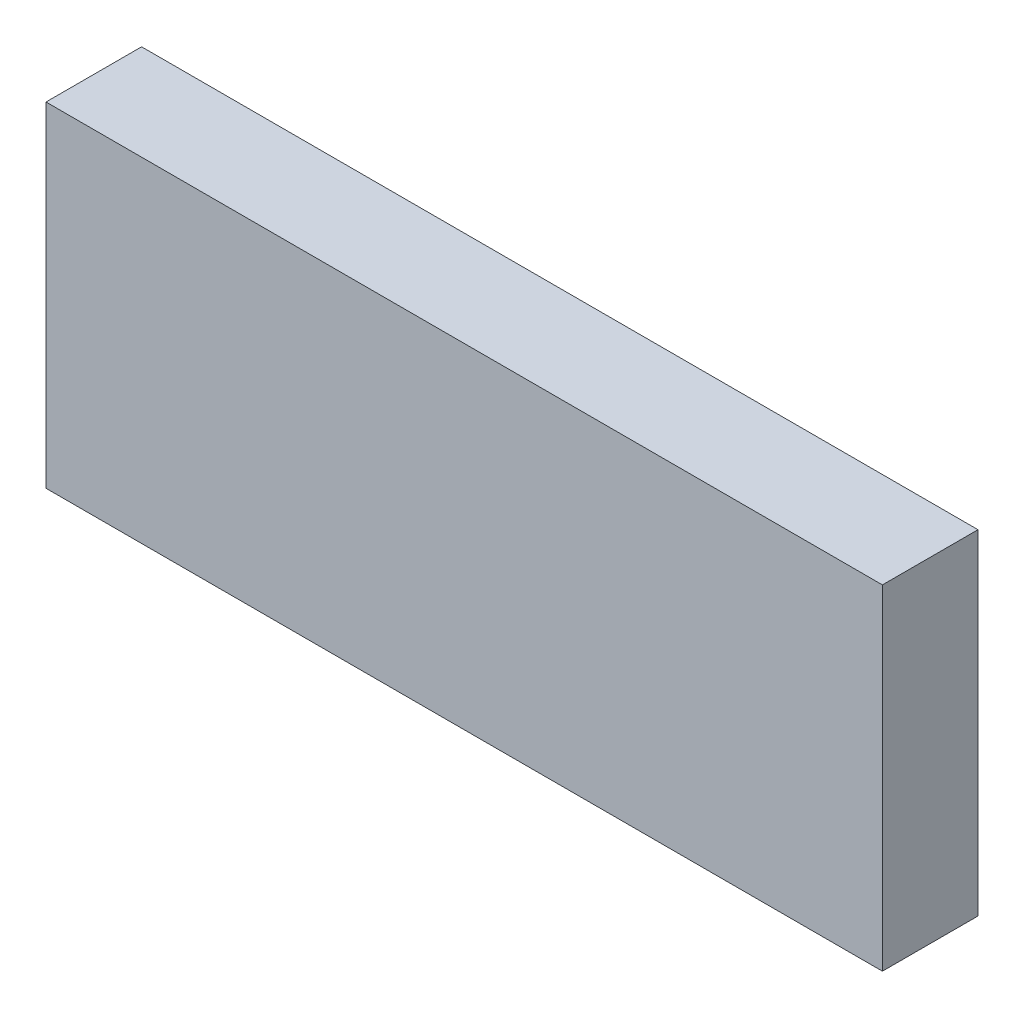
ISO-10303-21;
HEADER;
FILE_DESCRIPTION(('STEP AP214'),'2;1');
FILE_NAME('part.step','',(''),(''),'','','');
FILE_SCHEMA(('AUTOMOTIVE_DESIGN { 1 0 10303 214 1 1 1 1 }'));
ENDSEC;
DATA;
#1=APPLICATION_CONTEXT('core data for automotive mechanical design processes');
#2=APPLICATION_PROTOCOL_DEFINITION('international standard','automotive_design',2000,#1);
#3=PRODUCT_CONTEXT('',#1,'mechanical');
#4=PRODUCT('Part','Part','',(#3));
#5=PRODUCT_RELATED_PRODUCT_CATEGORY('part','',(#4));
#6=PRODUCT_DEFINITION_FORMATION('','',#4);
#7=PRODUCT_DEFINITION_CONTEXT('part definition',#1,'design');
#8=PRODUCT_DEFINITION('design','',#6,#7);
#9=PRODUCT_DEFINITION_SHAPE('','',#8);
#10=(LENGTH_UNIT() NAMED_UNIT(*) SI_UNIT(.MILLI.,.METRE.));
#11=(NAMED_UNIT(*) PLANE_ANGLE_UNIT() SI_UNIT($,.RADIAN.));
#12=(NAMED_UNIT(*) SI_UNIT($,.STERADIAN.) SOLID_ANGLE_UNIT());
#13=UNCERTAINTY_MEASURE_WITH_UNIT(LENGTH_MEASURE(1.E-05),#10,'distance_accuracy_value','');
#14=(GEOMETRIC_REPRESENTATION_CONTEXT(3) GLOBAL_UNCERTAINTY_ASSIGNED_CONTEXT((#13)) GLOBAL_UNIT_ASSIGNED_CONTEXT((#10,
#11,#12)) REPRESENTATION_CONTEXT('',''));
#15=CARTESIAN_POINT('',(0.,0.,0.));
#16=DIRECTION('',(0.,0.,1.));
#17=DIRECTION('',(1.,0.,0.));
#18=AXIS2_PLACEMENT_3D('',#15,#16,#17);
#19=CARTESIAN_POINT('',(0.,0.,4.));
#20=DIRECTION('',(1.,0.,0.));
#21=DIRECTION('',(0.,0.,-1.));
#22=AXIS2_PLACEMENT_3D('',#19,#20,#21);
#23=PLANE('',#22);
#24=DIRECTION('',(0.,-1.,0.));
#25=VECTOR('',#24,1.);
#26=CARTESIAN_POINT('',(0.,0.,0.));
#27=LINE('',#26,#25);
#28=CARTESIAN_POINT('',(0.,14.,0.));
#29=VERTEX_POINT('',#28);
#30=CARTESIAN_POINT('',(0.,0.,0.));
#31=VERTEX_POINT('',#30);
#32=EDGE_CURVE('E105',#29,#31,#27,.T.);
#33=ORIENTED_EDGE('',*,*,#32,.T.);
#34=DIRECTION('',(0.,0.,-1.));
#35=VECTOR('',#34,1.);
#36=CARTESIAN_POINT('',(0.,0.,4.));
#37=LINE('',#36,#35);
#38=CARTESIAN_POINT('',(0.,0.,4.));
#39=VERTEX_POINT('',#38);
#40=EDGE_CURVE('E11',#39,#31,#37,.T.);
#41=ORIENTED_EDGE('',*,*,#40,.F.);
#42=DIRECTION('',(0.,-1.,0.));
#43=VECTOR('',#42,1.);
#44=CARTESIAN_POINT('',(0.,0.,4.));
#45=LINE('',#44,#43);
#46=CARTESIAN_POINT('',(0.,14.,4.));
#47=VERTEX_POINT('',#46);
#48=EDGE_CURVE('E89',#47,#39,#45,.T.);
#49=ORIENTED_EDGE('',*,*,#48,.F.);
#50=DIRECTION('',(0.,0.,-1.));
#51=VECTOR('',#50,1.);
#52=CARTESIAN_POINT('',(0.,14.,4.));
#53=LINE('',#52,#51);
#54=EDGE_CURVE('E98',#47,#29,#53,.T.);
#55=ORIENTED_EDGE('',*,*,#54,.T.);
#56=EDGE_LOOP('',(#33,#41,#49,#55));
#57=FACE_BOUND('',#56,.T.);
#58=ADVANCED_FACE('F39',(#57),#23,.F.);
#59=CARTESIAN_POINT('',(0.,0.,4.));
#60=DIRECTION('',(0.,1.,0.));
#61=DIRECTION('',(0.,0.,1.));
#62=AXIS2_PLACEMENT_3D('',#59,#60,#61);
#63=PLANE('',#62);
#64=DIRECTION('',(1.,0.,0.));
#65=VECTOR('',#64,1.);
#66=CARTESIAN_POINT('',(0.,0.,0.));
#67=LINE('',#66,#65);
#68=CARTESIAN_POINT('',(35.,0.,0.));
#69=VERTEX_POINT('',#68);
#70=EDGE_CURVE('E94',#31,#69,#67,.T.);
#71=ORIENTED_EDGE('',*,*,#70,.T.);
#72=DIRECTION('',(0.,0.,-1.));
#73=VECTOR('',#72,1.);
#74=CARTESIAN_POINT('',(35.,0.,4.));
#75=LINE('',#74,#73);
#76=CARTESIAN_POINT('',(35.,0.,4.));
#77=VERTEX_POINT('',#76);
#78=EDGE_CURVE('E50',#77,#69,#75,.T.);
#79=ORIENTED_EDGE('',*,*,#78,.F.);
#80=DIRECTION('',(1.,0.,0.));
#81=VECTOR('',#80,1.);
#82=CARTESIAN_POINT('',(0.,0.,4.));
#83=LINE('',#82,#81);
#84=EDGE_CURVE('E83',#39,#77,#83,.T.);
#85=ORIENTED_EDGE('',*,*,#84,.F.);
#86=ORIENTED_EDGE('',*,*,#40,.T.);
#87=EDGE_LOOP('',(#71,#79,#85,#86));
#88=FACE_BOUND('',#87,.T.);
#89=ADVANCED_FACE('F91',(#88),#63,.F.);
#90=CARTESIAN_POINT('',(35.,0.,4.));
#91=DIRECTION('',(-1.,0.,0.));
#92=DIRECTION('',(0.,0.,1.));
#93=AXIS2_PLACEMENT_3D('',#90,#91,#92);
#94=PLANE('',#93);
#95=DIRECTION('',(0.,1.,0.));
#96=VECTOR('',#95,1.);
#97=CARTESIAN_POINT('',(35.,0.,0.));
#98=LINE('',#97,#96);
#99=CARTESIAN_POINT('',(35.,14.,0.));
#100=VERTEX_POINT('',#99);
#101=EDGE_CURVE('E75',#69,#100,#98,.T.);
#102=ORIENTED_EDGE('',*,*,#101,.T.);
#103=DIRECTION('',(0.,0.,-1.));
#104=VECTOR('',#103,1.);
#105=CARTESIAN_POINT('',(35.,14.,4.));
#106=LINE('',#105,#104);
#107=CARTESIAN_POINT('',(35.,14.,4.));
#108=VERTEX_POINT('',#107);
#109=EDGE_CURVE('E92',#108,#100,#106,.T.);
#110=ORIENTED_EDGE('',*,*,#109,.F.);
#111=DIRECTION('',(0.,1.,0.));
#112=VECTOR('',#111,1.);
#113=CARTESIAN_POINT('',(35.,0.,4.));
#114=LINE('',#113,#112);
#115=EDGE_CURVE('E86',#77,#108,#114,.T.);
#116=ORIENTED_EDGE('',*,*,#115,.F.);
#117=ORIENTED_EDGE('',*,*,#78,.T.);
#118=EDGE_LOOP('',(#102,#110,#116,#117));
#119=FACE_BOUND('',#118,.T.);
#120=ADVANCED_FACE('F96',(#119),#94,.F.);
#121=CARTESIAN_POINT('',(0.,14.,4.));
#122=DIRECTION('',(0.,-1.,0.));
#123=DIRECTION('',(0.,0.,-1.));
#124=AXIS2_PLACEMENT_3D('',#121,#122,#123);
#125=PLANE('',#124);
#126=DIRECTION('',(-1.,0.,0.));
#127=VECTOR('',#126,1.);
#128=CARTESIAN_POINT('',(0.,14.,0.));
#129=LINE('',#128,#127);
#130=EDGE_CURVE('E77',#100,#29,#129,.T.);
#131=ORIENTED_EDGE('',*,*,#130,.T.);
#132=ORIENTED_EDGE('',*,*,#54,.F.);
#133=DIRECTION('',(-1.,0.,0.));
#134=VECTOR('',#133,1.);
#135=CARTESIAN_POINT('',(0.,14.,4.));
#136=LINE('',#135,#134);
#137=EDGE_CURVE('E54',#108,#47,#136,.T.);
#138=ORIENTED_EDGE('',*,*,#137,.F.);
#139=ORIENTED_EDGE('',*,*,#109,.T.);
#140=EDGE_LOOP('',(#131,#132,#138,#139));
#141=FACE_BOUND('',#140,.T.);
#142=ADVANCED_FACE('F108',(#141),#125,.F.);
#143=CARTESIAN_POINT('',(0.,0.,4.));
#144=DIRECTION('',(0.,0.,-1.));
#145=DIRECTION('',(-1.,0.,0.));
#146=AXIS2_PLACEMENT_3D('',#143,#144,#145);
#147=PLANE('',#146);
#148=ORIENTED_EDGE('',*,*,#48,.T.);
#149=ORIENTED_EDGE('',*,*,#84,.T.);
#150=ORIENTED_EDGE('',*,*,#115,.T.);
#151=ORIENTED_EDGE('',*,*,#137,.T.);
#152=EDGE_LOOP('',(#148,#149,#150,#151));
#153=FACE_BOUND('',#152,.T.);
#154=ADVANCED_FACE('F88',(#153),#147,.F.);
#155=CARTESIAN_POINT('',(0.,0.,0.));
#156=DIRECTION('',(0.,0.,-1.));
#157=DIRECTION('',(-1.,0.,0.));
#158=AXIS2_PLACEMENT_3D('',#155,#156,#157);
#159=PLANE('',#158);
#160=ORIENTED_EDGE('',*,*,#32,.F.);
#161=ORIENTED_EDGE('',*,*,#130,.F.);
#162=ORIENTED_EDGE('',*,*,#101,.F.);
#163=ORIENTED_EDGE('',*,*,#70,.F.);
#164=EDGE_LOOP('',(#160,#161,#162,#163));
#165=FACE_BOUND('',#164,.T.);
#166=ADVANCED_FACE('F115',(#165),#159,.T.);
#167=CLOSED_SHELL('',(#58,#89,#120,#142,#154,#166));
#168=MANIFOLD_SOLID_BREP('B2',#167);
#169=ADVANCED_BREP_SHAPE_REPRESENTATION('',(#18,#168),#14);
#170=SHAPE_DEFINITION_REPRESENTATION(#9,#169);
ENDSEC;
END-ISO-10303-21;
